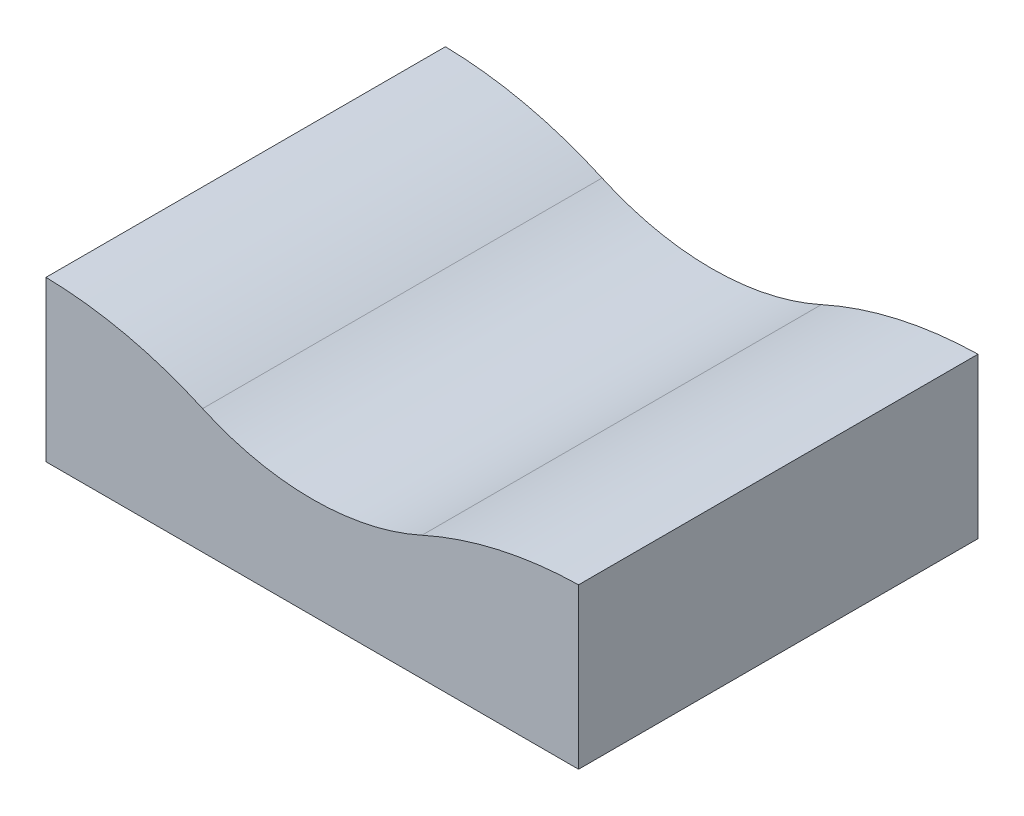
ISO-10303-21;
HEADER;
FILE_DESCRIPTION(('STEP AP214'),'2;1');
FILE_NAME('part.step','',(''),(''),'','','');
FILE_SCHEMA(('AUTOMOTIVE_DESIGN { 1 0 10303 214 1 1 1 1 }'));
ENDSEC;
DATA;
#1=APPLICATION_CONTEXT('core data for automotive mechanical design processes');
#2=APPLICATION_PROTOCOL_DEFINITION('international standard','automotive_design',2000,#1);
#3=PRODUCT_CONTEXT('',#1,'mechanical');
#4=PRODUCT('Part','Part','',(#3));
#5=PRODUCT_RELATED_PRODUCT_CATEGORY('part','',(#4));
#6=PRODUCT_DEFINITION_FORMATION('','',#4);
#7=PRODUCT_DEFINITION_CONTEXT('part definition',#1,'design');
#8=PRODUCT_DEFINITION('design','',#6,#7);
#9=PRODUCT_DEFINITION_SHAPE('','',#8);
#10=(LENGTH_UNIT() NAMED_UNIT(*) SI_UNIT(.MILLI.,.METRE.));
#11=(NAMED_UNIT(*) PLANE_ANGLE_UNIT() SI_UNIT($,.RADIAN.));
#12=(NAMED_UNIT(*) SI_UNIT($,.STERADIAN.) SOLID_ANGLE_UNIT());
#13=UNCERTAINTY_MEASURE_WITH_UNIT(LENGTH_MEASURE(1.E-05),#10,'distance_accuracy_value','');
#14=(GEOMETRIC_REPRESENTATION_CONTEXT(3) GLOBAL_UNCERTAINTY_ASSIGNED_CONTEXT((#13)) GLOBAL_UNIT_ASSIGNED_CONTEXT((#10,
#11,#12)) REPRESENTATION_CONTEXT('',''));
#15=CARTESIAN_POINT('',(0.,0.,0.));
#16=DIRECTION('',(0.,0.,1.));
#17=DIRECTION('',(1.,0.,0.));
#18=AXIS2_PLACEMENT_3D('',#15,#16,#17);
#19=CARTESIAN_POINT('',(0.,137.843413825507,75.));
#20=DIRECTION('',(0.,0.,1.));
#21=DIRECTION('',(1.,0.,0.));
#22=AXIS2_PLACEMENT_3D('',#19,#20,#21);
#23=CYLINDRICAL_SURFACE('',#22,100.);
#24=DIRECTION('',(0.,0.,-1.));
#25=VECTOR('',#24,1.);
#26=CARTESIAN_POINT('',(-41.1838499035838,46.7177286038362,75.));
#27=LINE('',#26,#25);
#28=CARTESIAN_POINT('',(-41.1838499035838,46.7177286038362,75.));
#29=VERTEX_POINT('',#28);
#30=CARTESIAN_POINT('',(-41.1838499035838,46.7177286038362,-75.));
#31=VERTEX_POINT('',#30);
#32=EDGE_CURVE('E89',#29,#31,#27,.T.);
#33=ORIENTED_EDGE('',*,*,#32,.F.);
#34=CARTESIAN_POINT('',(0.,137.843413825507,75.));
#35=DIRECTION('',(0.,0.,-1.));
#36=DIRECTION('',(-1.,0.,0.));
#37=AXIS2_PLACEMENT_3D('',#34,#35,#36);
#38=CIRCLE('',#37,100.);
#39=CARTESIAN_POINT('',(41.1838499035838,46.7177286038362,75.));
#40=VERTEX_POINT('',#39);
#41=EDGE_CURVE('E40',#29,#40,#38,.F.);
#42=ORIENTED_EDGE('',*,*,#41,.T.);
#43=DIRECTION('',(0.,0.,-1.));
#44=VECTOR('',#43,1.);
#45=CARTESIAN_POINT('',(41.1838499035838,46.7177286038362,75.));
#46=LINE('',#45,#44);
#47=CARTESIAN_POINT('',(41.1838499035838,46.7177286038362,-75.));
#48=VERTEX_POINT('',#47);
#49=EDGE_CURVE('E105',#48,#40,#46,.F.);
#50=ORIENTED_EDGE('',*,*,#49,.F.);
#51=CARTESIAN_POINT('',(0.,137.843413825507,-75.));
#52=DIRECTION('',(0.,0.,-1.));
#53=DIRECTION('',(-1.,0.,0.));
#54=AXIS2_PLACEMENT_3D('',#51,#52,#53);
#55=CIRCLE('',#54,100.);
#56=EDGE_CURVE('E11',#48,#31,#55,.T.);
#57=ORIENTED_EDGE('',*,*,#56,.T.);
#58=EDGE_LOOP('',(#33,#42,#50,#57));
#59=FACE_BOUND('',#58,.T.);
#60=ADVANCED_FACE('F33',(#59),#23,.F.);
#61=CARTESIAN_POINT('',(-102.95962475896,-89.9707992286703,75.));
#62=DIRECTION('',(0.,0.,-1.));
#63=DIRECTION('',(-1.,0.,0.));
#64=AXIS2_PLACEMENT_3D('',#61,#62,#63);
#65=CYLINDRICAL_SURFACE('',#64,150.);
#66=CARTESIAN_POINT('',(-102.95962475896,-89.9707992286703,75.));
#67=DIRECTION('',(0.,0.,1.));
#68=DIRECTION('',(-1.,0.,0.));
#69=AXIS2_PLACEMENT_3D('',#66,#67,#68);
#70=CIRCLE('',#69,150.);
#71=CARTESIAN_POINT('',(-100.,60.,75.));
#72=VERTEX_POINT('',#71);
#73=EDGE_CURVE('E138',#29,#72,#70,.T.);
#74=ORIENTED_EDGE('',*,*,#73,.F.);
#75=ORIENTED_EDGE('',*,*,#32,.T.);
#76=CARTESIAN_POINT('',(-102.95962475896,-89.9707992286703,-75.));
#77=DIRECTION('',(0.,0.,1.));
#78=DIRECTION('',(-1.,0.,0.));
#79=AXIS2_PLACEMENT_3D('',#76,#77,#78);
#80=CIRCLE('',#79,150.);
#81=CARTESIAN_POINT('',(-100.,60.,-75.));
#82=VERTEX_POINT('',#81);
#83=EDGE_CURVE('E83',#31,#82,#80,.T.);
#84=ORIENTED_EDGE('',*,*,#83,.T.);
#85=DIRECTION('',(0.,0.,-1.));
#86=VECTOR('',#85,1.);
#87=CARTESIAN_POINT('',(-100.,60.,75.));
#88=LINE('',#87,#86);
#89=EDGE_CURVE('E88',#72,#82,#88,.T.);
#90=ORIENTED_EDGE('',*,*,#89,.F.);
#91=EDGE_LOOP('',(#74,#75,#84,#90));
#92=FACE_BOUND('',#91,.T.);
#93=ADVANCED_FACE('F86',(#92),#65,.T.);
#94=CARTESIAN_POINT('',(-100.,0.,75.));
#95=DIRECTION('',(1.,0.,0.));
#96=DIRECTION('',(0.,0.,-1.));
#97=AXIS2_PLACEMENT_3D('',#94,#95,#96);
#98=PLANE('',#97);
#99=DIRECTION('',(0.,-1.,0.));
#100=VECTOR('',#99,1.);
#101=CARTESIAN_POINT('',(-100.,0.,-75.));
#102=LINE('',#101,#100);
#103=CARTESIAN_POINT('',(-100.,0.,-75.));
#104=VERTEX_POINT('',#103);
#105=EDGE_CURVE('E90',#82,#104,#102,.T.);
#106=ORIENTED_EDGE('',*,*,#105,.T.);
#107=DIRECTION('',(0.,0.,-1.));
#108=VECTOR('',#107,1.);
#109=CARTESIAN_POINT('',(-100.,0.,75.));
#110=LINE('',#109,#108);
#111=CARTESIAN_POINT('',(-100.,0.,75.));
#112=VERTEX_POINT('',#111);
#113=EDGE_CURVE('E103',#112,#104,#110,.T.);
#114=ORIENTED_EDGE('',*,*,#113,.F.);
#115=DIRECTION('',(0.,-1.,0.));
#116=VECTOR('',#115,1.);
#117=CARTESIAN_POINT('',(-100.,0.,75.));
#118=LINE('',#117,#116);
#119=EDGE_CURVE('E102',#72,#112,#118,.T.);
#120=ORIENTED_EDGE('',*,*,#119,.F.);
#121=ORIENTED_EDGE('',*,*,#89,.T.);
#122=EDGE_LOOP('',(#106,#114,#120,#121));
#123=FACE_BOUND('',#122,.T.);
#124=ADVANCED_FACE('F101',(#123),#98,.F.);
#125=CARTESIAN_POINT('',(100.,0.,75.));
#126=DIRECTION('',(0.,1.,0.));
#127=DIRECTION('',(0.,0.,1.));
#128=AXIS2_PLACEMENT_3D('',#125,#126,#127);
#129=PLANE('',#128);
#130=DIRECTION('',(1.,0.,0.));
#131=VECTOR('',#130,1.);
#132=CARTESIAN_POINT('',(100.,0.,-75.));
#133=LINE('',#132,#131);
#134=CARTESIAN_POINT('',(100.,0.,-75.));
#135=VERTEX_POINT('',#134);
#136=EDGE_CURVE('E95',#104,#135,#133,.T.);
#137=ORIENTED_EDGE('',*,*,#136,.T.);
#138=DIRECTION('',(0.,0.,-1.));
#139=VECTOR('',#138,1.);
#140=CARTESIAN_POINT('',(100.,0.,75.));
#141=LINE('',#140,#139);
#142=CARTESIAN_POINT('',(100.,0.,75.));
#143=VERTEX_POINT('',#142);
#144=EDGE_CURVE('E107',#143,#135,#141,.T.);
#145=ORIENTED_EDGE('',*,*,#144,.F.);
#146=DIRECTION('',(1.,0.,0.));
#147=VECTOR('',#146,1.);
#148=CARTESIAN_POINT('',(100.,0.,75.));
#149=LINE('',#148,#147);
#150=EDGE_CURVE('E127',#112,#143,#149,.T.);
#151=ORIENTED_EDGE('',*,*,#150,.F.);
#152=ORIENTED_EDGE('',*,*,#113,.T.);
#153=EDGE_LOOP('',(#137,#145,#151,#152));
#154=FACE_BOUND('',#153,.T.);
#155=ADVANCED_FACE('F143',(#154),#129,.F.);
#156=CARTESIAN_POINT('',(100.,0.,75.));
#157=DIRECTION('',(-1.,0.,0.));
#158=DIRECTION('',(0.,0.,1.));
#159=AXIS2_PLACEMENT_3D('',#156,#157,#158);
#160=PLANE('',#159);
#161=DIRECTION('',(0.,1.,0.));
#162=VECTOR('',#161,1.);
#163=CARTESIAN_POINT('',(100.,0.,-75.));
#164=LINE('',#163,#162);
#165=CARTESIAN_POINT('',(100.,60.,-75.));
#166=VERTEX_POINT('',#165);
#167=EDGE_CURVE('E134',#135,#166,#164,.T.);
#168=ORIENTED_EDGE('',*,*,#167,.T.);
#169=DIRECTION('',(0.,0.,-1.));
#170=VECTOR('',#169,1.);
#171=CARTESIAN_POINT('',(100.,60.,75.));
#172=LINE('',#171,#170);
#173=CARTESIAN_POINT('',(100.,60.,75.));
#174=VERTEX_POINT('',#173);
#175=EDGE_CURVE('E124',#174,#166,#172,.T.);
#176=ORIENTED_EDGE('',*,*,#175,.F.);
#177=DIRECTION('',(0.,1.,0.));
#178=VECTOR('',#177,1.);
#179=CARTESIAN_POINT('',(100.,0.,75.));
#180=LINE('',#179,#178);
#181=EDGE_CURVE('E122',#143,#174,#180,.T.);
#182=ORIENTED_EDGE('',*,*,#181,.F.);
#183=ORIENTED_EDGE('',*,*,#144,.T.);
#184=EDGE_LOOP('',(#168,#176,#182,#183));
#185=FACE_BOUND('',#184,.T.);
#186=ADVANCED_FACE('F133',(#185),#160,.F.);
#187=CARTESIAN_POINT('',(102.95962475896,-89.9707992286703,75.));
#188=DIRECTION('',(0.,0.,-1.));
#189=DIRECTION('',(-1.,0.,0.));
#190=AXIS2_PLACEMENT_3D('',#187,#188,#189);
#191=CYLINDRICAL_SURFACE('',#190,150.);
#192=CARTESIAN_POINT('',(102.95962475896,-89.9707992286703,-75.));
#193=DIRECTION('',(0.,0.,1.));
#194=DIRECTION('',(1.,0.,0.));
#195=AXIS2_PLACEMENT_3D('',#192,#193,#194);
#196=CIRCLE('',#195,150.);
#197=EDGE_CURVE('E118',#166,#48,#196,.T.);
#198=ORIENTED_EDGE('',*,*,#197,.T.);
#199=ORIENTED_EDGE('',*,*,#49,.T.);
#200=CARTESIAN_POINT('',(102.95962475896,-89.9707992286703,75.));
#201=DIRECTION('',(0.,0.,1.));
#202=DIRECTION('',(1.,0.,0.));
#203=AXIS2_PLACEMENT_3D('',#200,#201,#202);
#204=CIRCLE('',#203,150.);
#205=EDGE_CURVE('E117',#174,#40,#204,.T.);
#206=ORIENTED_EDGE('',*,*,#205,.F.);
#207=ORIENTED_EDGE('',*,*,#175,.T.);
#208=EDGE_LOOP('',(#198,#199,#206,#207));
#209=FACE_BOUND('',#208,.T.);
#210=ADVANCED_FACE('F115',(#209),#191,.T.);
#211=CARTESIAN_POINT('',(-102.95962475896,-89.9707992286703,75.));
#212=DIRECTION('',(0.,0.,-1.));
#213=DIRECTION('',(-1.,0.,0.));
#214=AXIS2_PLACEMENT_3D('',#211,#212,#213);
#215=PLANE('',#214);
#216=ORIENTED_EDGE('',*,*,#41,.F.);
#217=ORIENTED_EDGE('',*,*,#73,.T.);
#218=ORIENTED_EDGE('',*,*,#119,.T.);
#219=ORIENTED_EDGE('',*,*,#150,.T.);
#220=ORIENTED_EDGE('',*,*,#181,.T.);
#221=ORIENTED_EDGE('',*,*,#205,.T.);
#222=EDGE_LOOP('',(#216,#217,#218,#219,#220,#221));
#223=FACE_BOUND('',#222,.T.);
#224=ADVANCED_FACE('F120',(#223),#215,.F.);
#225=CARTESIAN_POINT('',(-102.95962475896,-89.9707992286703,-75.));
#226=DIRECTION('',(0.,0.,-1.));
#227=DIRECTION('',(-1.,0.,0.));
#228=AXIS2_PLACEMENT_3D('',#225,#226,#227);
#229=PLANE('',#228);
#230=ORIENTED_EDGE('',*,*,#83,.F.);
#231=ORIENTED_EDGE('',*,*,#56,.F.);
#232=ORIENTED_EDGE('',*,*,#197,.F.);
#233=ORIENTED_EDGE('',*,*,#167,.F.);
#234=ORIENTED_EDGE('',*,*,#136,.F.);
#235=ORIENTED_EDGE('',*,*,#105,.F.);
#236=EDGE_LOOP('',(#230,#231,#232,#233,#234,#235));
#237=FACE_BOUND('',#236,.T.);
#238=ADVANCED_FACE('F93',(#237),#229,.T.);
#239=CLOSED_SHELL('',(#60,#93,#124,#155,#186,#210,#224,#238));
#240=MANIFOLD_SOLID_BREP('B2',#239);
#241=ADVANCED_BREP_SHAPE_REPRESENTATION('',(#18,#240),#14);
#242=SHAPE_DEFINITION_REPRESENTATION(#9,#241);
ENDSEC;
END-ISO-10303-21;
